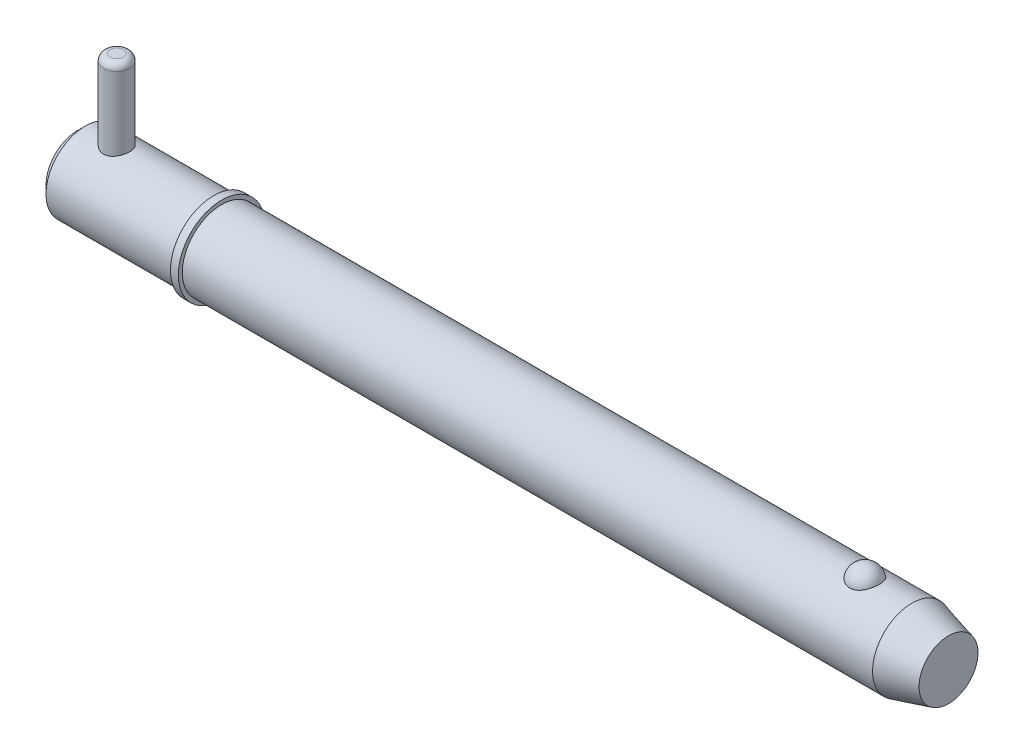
ISO-10303-21;
HEADER;
FILE_DESCRIPTION(('STEP AP214'),'2;1');
FILE_NAME('part.step','',(''),(''),'','','');
FILE_SCHEMA(('AUTOMOTIVE_DESIGN { 1 0 10303 214 1 1 1 1 }'));
ENDSEC;
DATA;
#1=APPLICATION_CONTEXT('core data for automotive mechanical design processes');
#2=APPLICATION_PROTOCOL_DEFINITION('international standard','automotive_design',2000,#1);
#3=PRODUCT_CONTEXT('',#1,'mechanical');
#4=PRODUCT('Part','Part','',(#3));
#5=PRODUCT_RELATED_PRODUCT_CATEGORY('part','',(#4));
#6=PRODUCT_DEFINITION_FORMATION('','',#4);
#7=PRODUCT_DEFINITION_CONTEXT('part definition',#1,'design');
#8=PRODUCT_DEFINITION('design','',#6,#7);
#9=PRODUCT_DEFINITION_SHAPE('','',#8);
#10=(LENGTH_UNIT() NAMED_UNIT(*) SI_UNIT(.MILLI.,.METRE.));
#11=(NAMED_UNIT(*) PLANE_ANGLE_UNIT() SI_UNIT($,.RADIAN.));
#12=(NAMED_UNIT(*) SI_UNIT($,.STERADIAN.) SOLID_ANGLE_UNIT());
#13=UNCERTAINTY_MEASURE_WITH_UNIT(LENGTH_MEASURE(1.E-05),#10,'distance_accuracy_value','');
#14=(GEOMETRIC_REPRESENTATION_CONTEXT(3) GLOBAL_UNCERTAINTY_ASSIGNED_CONTEXT((#13)) GLOBAL_UNIT_ASSIGNED_CONTEXT((#10,
#11,#12)) REPRESENTATION_CONTEXT('',''));
#15=CARTESIAN_POINT('',(0.,0.,0.));
#16=DIRECTION('',(0.,0.,1.));
#17=DIRECTION('',(1.,0.,0.));
#18=AXIS2_PLACEMENT_3D('',#15,#16,#17);
#19=CARTESIAN_POINT('',(9.52500000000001,28.575,0.));
#20=DIRECTION('',(0.,-1.,0.));
#21=DIRECTION('',(0.,0.,-1.));
#22=AXIS2_PLACEMENT_3D('',#19,#20,#21);
#23=CYLINDRICAL_SURFACE('',#22,3.175);
#24=CARTESIAN_POINT('',(9.52500000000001,-7.93750000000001,0.));
#25=DIRECTION('',(0.,1.,0.));
#26=DIRECTION('',(0.,0.,1.));
#27=AXIS2_PLACEMENT_3D('',#24,#25,#26);
#28=CIRCLE('',#27,3.175);
#29=CARTESIAN_POINT('',(9.52500000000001,-7.93750000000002,-3.175));
#30=VERTEX_POINT('',#29);
#31=EDGE_CURVE('P0_E25',#30,#30,#28,.T.);
#32=CARTESIAN_POINT('',(9.52500000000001,26.9875,0.));
#33=DIRECTION('',(0.,1.,0.));
#34=DIRECTION('',(0.,0.,1.));
#35=AXIS2_PLACEMENT_3D('',#32,#33,#34);
#36=CIRCLE('',#35,3.175);
#37=CARTESIAN_POINT('',(9.52500000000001,26.9875,-3.175));
#38=VERTEX_POINT('',#37);
#39=EDGE_CURVE('P0_E29',#38,#38,#36,.F.);
#40=CARTESIAN_POINT('',(9.52500000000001,-7.93750000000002,-3.175));
#41=CARTESIAN_POINT('',(9.52500000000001,-7.57369791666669,-3.175));
#42=CARTESIAN_POINT('',(9.52500000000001,-7.20989583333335,-3.175));
#43=CARTESIAN_POINT('',(9.52500000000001,-6.48229166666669,-3.175));
#44=CARTESIAN_POINT('',(9.52500000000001,-6.11848958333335,-3.175));
#45=CARTESIAN_POINT('',(9.52500000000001,-5.39088541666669,-3.175));
#46=CARTESIAN_POINT('',(9.52500000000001,-5.02708333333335,-3.175));
#47=CARTESIAN_POINT('',(9.52500000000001,-4.29947916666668,-3.175));
#48=CARTESIAN_POINT('',(9.52500000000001,-3.93567708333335,-3.175));
#49=CARTESIAN_POINT('',(9.52500000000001,-3.20807291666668,-3.175));
#50=CARTESIAN_POINT('',(9.52500000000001,-2.84427083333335,-3.175));
#51=CARTESIAN_POINT('',(9.52500000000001,-2.11666666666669,-3.175));
#52=CARTESIAN_POINT('',(9.52500000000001,-1.75286458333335,-3.175));
#53=CARTESIAN_POINT('',(9.52500000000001,-1.02526041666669,-3.175));
#54=CARTESIAN_POINT('',(9.52500000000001,-0.661458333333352,-3.175));
#55=CARTESIAN_POINT('',(9.52500000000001,0.0661458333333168,-3.175));
#56=CARTESIAN_POINT('',(9.52500000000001,0.429947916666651,-3.175));
#57=CARTESIAN_POINT('',(9.52500000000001,1.15755208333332,-3.175));
#58=CARTESIAN_POINT('',(9.52500000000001,1.52135416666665,-3.175));
#59=CARTESIAN_POINT('',(9.52500000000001,2.24895833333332,-3.175));
#60=CARTESIAN_POINT('',(9.52500000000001,2.61276041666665,-3.175));
#61=CARTESIAN_POINT('',(9.52500000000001,3.34036458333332,-3.175));
#62=CARTESIAN_POINT('',(9.52500000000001,3.70416666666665,-3.175));
#63=CARTESIAN_POINT('',(9.52500000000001,4.43177083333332,-3.175));
#64=CARTESIAN_POINT('',(9.52500000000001,4.79557291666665,-3.175));
#65=CARTESIAN_POINT('',(9.52500000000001,5.52317708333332,-3.175));
#66=CARTESIAN_POINT('',(9.52500000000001,5.88697916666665,-3.175));
#67=CARTESIAN_POINT('',(9.52500000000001,6.61458333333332,-3.175));
#68=CARTESIAN_POINT('',(9.52500000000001,6.97838541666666,-3.175));
#69=CARTESIAN_POINT('',(9.52500000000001,7.70598958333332,-3.175));
#70=CARTESIAN_POINT('',(9.52500000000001,8.06979166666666,-3.175));
#71=CARTESIAN_POINT('',(9.52500000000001,8.79739583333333,-3.175));
#72=CARTESIAN_POINT('',(9.52500000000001,9.16119791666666,-3.175));
#73=CARTESIAN_POINT('',(9.52500000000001,9.88880208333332,-3.175));
#74=CARTESIAN_POINT('',(9.52500000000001,10.2526041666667,-3.175));
#75=CARTESIAN_POINT('',(9.52500000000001,10.9802083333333,-3.175));
#76=CARTESIAN_POINT('',(9.52500000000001,11.3440104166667,-3.175));
#77=CARTESIAN_POINT('',(9.52500000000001,12.0716145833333,-3.175));
#78=CARTESIAN_POINT('',(9.52500000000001,12.4354166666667,-3.175));
#79=CARTESIAN_POINT('',(9.52500000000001,13.1630208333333,-3.175));
#80=CARTESIAN_POINT('',(9.52500000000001,13.5268229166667,-3.175));
#81=CARTESIAN_POINT('',(9.52500000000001,14.2544270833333,-3.175));
#82=CARTESIAN_POINT('',(9.52500000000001,14.6182291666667,-3.175));
#83=CARTESIAN_POINT('',(9.52500000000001,15.3458333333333,-3.175));
#84=CARTESIAN_POINT('',(9.52500000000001,15.7096354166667,-3.175));
#85=CARTESIAN_POINT('',(9.52500000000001,16.4372395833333,-3.175));
#86=CARTESIAN_POINT('',(9.52500000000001,16.8010416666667,-3.175));
#87=CARTESIAN_POINT('',(9.52500000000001,17.5286458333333,-3.175));
#88=CARTESIAN_POINT('',(9.52500000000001,17.8924479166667,-3.175));
#89=CARTESIAN_POINT('',(9.52500000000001,18.6200520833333,-3.175));
#90=CARTESIAN_POINT('',(9.52500000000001,18.9838541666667,-3.175));
#91=CARTESIAN_POINT('',(9.52500000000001,19.7114583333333,-3.175));
#92=CARTESIAN_POINT('',(9.52500000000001,20.0752604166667,-3.175));
#93=CARTESIAN_POINT('',(9.52500000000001,20.8028645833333,-3.175));
#94=CARTESIAN_POINT('',(9.52500000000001,21.1666666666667,-3.175));
#95=CARTESIAN_POINT('',(9.52500000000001,21.8942708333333,-3.175));
#96=CARTESIAN_POINT('',(9.52500000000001,22.2580729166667,-3.175));
#97=CARTESIAN_POINT('',(9.52500000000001,22.9856770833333,-3.175));
#98=CARTESIAN_POINT('',(9.52500000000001,23.3494791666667,-3.175));
#99=CARTESIAN_POINT('',(9.52500000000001,24.0770833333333,-3.175));
#100=CARTESIAN_POINT('',(9.52500000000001,24.4408854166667,-3.175));
#101=CARTESIAN_POINT('',(9.52500000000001,25.1684895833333,-3.175));
#102=CARTESIAN_POINT('',(9.52500000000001,25.5322916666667,-3.175));
#103=CARTESIAN_POINT('',(9.52500000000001,26.2598958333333,-3.175));
#104=CARTESIAN_POINT('',(9.52500000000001,26.6236979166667,-3.175));
#105=CARTESIAN_POINT('',(9.52500000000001,26.9875,-3.175));
#106=B_SPLINE_CURVE_WITH_KNOTS('',3,(#40,#41,#42,#43,#44,#45,#46,#47,#48,#49,#50,#51,#52,#53,
#54,#55,#56,#57,#58,#59,#60,#61,#62,#63,#64,#65,#66,#67,#68,#69,#70,#71,#72,#73,#74,#75,#76,#77,
#78,#79,#80,#81,#82,#83,#84,#85,#86,#87,#88,#89,#90,#91,#92,#93,#94,#95,#96,#97,#98,#99,#100,
#101,#102,#103,#104,#105),.UNSPECIFIED.,.F.,.F.,(4,2,2,2,2,2,2,2,2,2,2,2,2,2,2,2,2,2,2,2,2,2,2,
2,2,2,2,2,2,2,2,2,4),(0.,1.09140625,2.1828125,3.27421875,4.365625,5.45703125,6.5484375,
7.63984375,8.73125000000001,9.82265625,10.9140625,12.00546875,13.096875,14.18828125,15.2796875,
16.37109375,17.4625,18.55390625,19.6453125,20.73671875,21.828125,22.91953125,24.0109375,
25.10234375,26.19375,27.28515625,28.3765625,29.46796875,30.559375,31.65078125,32.7421875,
33.83359375,34.925),.UNSPECIFIED.);
#107=EDGE_CURVE('P0_BSEAM14',#30,#38,#106,.T.);
#108=ORIENTED_EDGE('',*,*,#31,.T.);
#109=ORIENTED_EDGE('',*,*,#39,.T.);
#110=ORIENTED_EDGE('',*,*,#107,.T.);
#111=ORIENTED_EDGE('',*,*,#107,.F.);
#112=EDGE_LOOP('',(#108,#110,#109,#111));
#113=FACE_BOUND('',#112,.T.);
#114=ADVANCED_FACE('P0_F14',(#113),#23,.T.);
#115=CARTESIAN_POINT('',(9.52500000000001,28.575,0.));
#116=DIRECTION('',(0.,1.,0.));
#117=DIRECTION('',(0.,0.,1.));
#118=AXIS2_PLACEMENT_3D('',#115,#116,#117);
#119=PLANE('',#118);
#120=CARTESIAN_POINT('',(9.52500000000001,28.575,0.));
#121=DIRECTION('',(0.,1.,0.));
#122=DIRECTION('',(0.,0.,1.));
#123=AXIS2_PLACEMENT_3D('',#120,#121,#122);
#124=CIRCLE('',#123,1.5875);
#125=CARTESIAN_POINT('',(9.52500000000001,28.575,1.5875));
#126=VERTEX_POINT('',#125);
#127=EDGE_CURVE('P0_E10',#126,#126,#124,.T.);
#128=ORIENTED_EDGE('',*,*,#127,.T.);
#129=EDGE_LOOP('',(#128));
#130=FACE_BOUND('',#129,.T.);
#131=ADVANCED_FACE('P0_F46',(#130),#119,.T.);
#132=CARTESIAN_POINT('',(9.52500000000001,-9.525,0.));
#133=DIRECTION('',(0.,1.,0.));
#134=DIRECTION('',(0.,0.,1.));
#135=AXIS2_PLACEMENT_3D('',#132,#133,#134);
#136=PLANE('',#135);
#137=CARTESIAN_POINT('',(9.52500000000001,-9.525,0.));
#138=DIRECTION('',(0.,1.,0.));
#139=DIRECTION('',(0.,0.,1.));
#140=AXIS2_PLACEMENT_3D('',#137,#138,#139);
#141=CIRCLE('',#140,1.5875);
#142=CARTESIAN_POINT('',(9.52500000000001,-9.525,1.5875));
#143=VERTEX_POINT('',#142);
#144=EDGE_CURVE('P0_E21',#143,#143,#141,.F.);
#145=ORIENTED_EDGE('',*,*,#144,.T.);
#146=EDGE_LOOP('',(#145));
#147=FACE_BOUND('',#146,.T.);
#148=ADVANCED_FACE('P0_F43',(#147),#136,.F.);
#149=CARTESIAN_POINT('',(9.52500000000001,-7.9375,0.));
#150=DIRECTION('',(0.,1.,0.));
#151=DIRECTION('',(0.,0.,1.));
#152=AXIS2_PLACEMENT_3D('',#149,#150,#151);
#153=DEGENERATE_TOROIDAL_SURFACE('',#152,1.5875,1.5875,.T.);
#154=ORIENTED_EDGE('',*,*,#144,.F.);
#155=EDGE_LOOP('',(#154));
#156=FACE_BOUND('',#155,.T.);
#157=ORIENTED_EDGE('',*,*,#31,.F.);
#158=EDGE_LOOP('',(#157));
#159=FACE_BOUND('',#158,.T.);
#160=ADVANCED_FACE('P0_F38',(#156,#159),#153,.T.);
#161=CARTESIAN_POINT('',(9.52500000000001,26.9875,0.));
#162=DIRECTION('',(0.,1.,0.));
#163=DIRECTION('',(0.,0.,1.));
#164=AXIS2_PLACEMENT_3D('',#161,#162,#163);
#165=DEGENERATE_TOROIDAL_SURFACE('',#164,1.5875,1.5875,.T.);
#166=ORIENTED_EDGE('',*,*,#39,.F.);
#167=EDGE_LOOP('',(#166));
#168=FACE_BOUND('',#167,.T.);
#169=ORIENTED_EDGE('',*,*,#127,.F.);
#170=EDGE_LOOP('',(#169));
#171=FACE_BOUND('',#170,.T.);
#172=ADVANCED_FACE('P0_F16',(#168,#171),#165,.T.);
#173=CLOSED_SHELL('',(#114,#131,#148,#160,#172));
#174=MANIFOLD_SOLID_BREP('P0_B1',#173);
#175=CARTESIAN_POINT('',(0.,0.,0.));
#176=DIRECTION('',(1.,0.,0.));
#177=DIRECTION('',(0.,0.,-1.));
#178=AXIS2_PLACEMENT_3D('',#175,#176,#177);
#179=CYLINDRICAL_SURFACE('',#178,9.525);
#180=CARTESIAN_POINT('',(202.243054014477,0.,0.));
#181=DIRECTION('',(1.,0.,0.));
#182=DIRECTION('',(0.,0.,-1.));
#183=AXIS2_PLACEMENT_3D('',#180,#181,#182);
#184=CIRCLE('',#183,9.525);
#185=CARTESIAN_POINT('',(202.243054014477,0.,-9.525));
#186=VERTEX_POINT('',#185);
#187=EDGE_CURVE('P1_E81',#186,#186,#184,.T.);
#188=ORIENTED_EDGE('',*,*,#187,.F.);
#189=EDGE_LOOP('',(#188));
#190=FACE_BOUND('',#189,.T.);
#191=CARTESIAN_POINT('',(34.93,0.,0.));
#192=DIRECTION('',(1.,0.,0.));
#193=DIRECTION('',(0.,0.,-1.));
#194=AXIS2_PLACEMENT_3D('',#191,#192,#193);
#195=CIRCLE('',#194,9.525);
#196=CARTESIAN_POINT('',(34.93,0.,-9.525));
#197=VERTEX_POINT('',#196);
#198=EDGE_CURVE('P1_E85',#197,#197,#195,.T.);
#199=ORIENTED_EDGE('',*,*,#198,.T.);
#200=EDGE_LOOP('',(#199));
#201=FACE_BOUND('',#200,.T.);
#202=CARTESIAN_POINT('',(190.845757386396,8.80405803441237,3.63513233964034));
#203=CARTESIAN_POINT('',(190.751676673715,8.80405953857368,3.63513053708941));
#204=CARTESIAN_POINT('',(190.657561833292,8.80561325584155,3.63137461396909));
#205=CARTESIAN_POINT('',(190.470012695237,8.81177748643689,3.61638665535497));
#206=CARTESIAN_POINT('',(190.376578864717,8.81638992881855,3.60514990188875));
#207=CARTESIAN_POINT('',(190.097945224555,8.83467114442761,3.56024627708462));
#208=CARTESIAN_POINT('',(189.914691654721,8.85278327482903,3.51538626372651));
#209=CARTESIAN_POINT('',(189.559509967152,8.89871214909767,3.39742145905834));
#210=CARTESIAN_POINT('',(189.387553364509,8.92650327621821,3.32439116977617));
#211=CARTESIAN_POINT('',(189.058707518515,8.98874819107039,3.15220244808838));
#212=CARTESIAN_POINT('',(188.901811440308,9.02319893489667,3.05305594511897));
#213=CARTESIAN_POINT('',(188.602214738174,9.09629186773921,2.82797815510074));
#214=CARTESIAN_POINT('',(188.460060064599,9.13502685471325,2.70135138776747));
#215=CARTESIAN_POINT('',(188.198299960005,9.21186572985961,2.42641932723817));
#216=CARTESIAN_POINT('',(188.078701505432,9.24996941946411,2.2781073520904));
#217=CARTESIAN_POINT('',(187.859645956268,9.32341082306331,1.95652290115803));
#218=CARTESIAN_POINT('',(187.761317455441,9.35855090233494,1.78243511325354));
#219=CARTESIAN_POINT('',(187.593819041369,9.42045142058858,1.41937246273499));
#220=CARTESIAN_POINT('',(187.524651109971,9.44721128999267,1.23039658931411));
#221=CARTESIAN_POINT('',(187.416199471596,9.48990641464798,0.840370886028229));
#222=CARTESIAN_POINT('',(187.377288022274,9.50570658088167,0.639202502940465));
#223=CARTESIAN_POINT('',(187.331555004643,9.52433146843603,0.232664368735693));
#224=CARTESIAN_POINT('',(187.324732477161,9.52715657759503,0.0272947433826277));
#225=CARTESIAN_POINT('',(187.343255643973,9.51956918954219,-0.380478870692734));
#226=CARTESIAN_POINT('',(187.368405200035,9.50923740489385,-0.582893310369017));
#227=CARTESIAN_POINT('',(187.45002537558,9.47651897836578,-0.980293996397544));
#228=CARTESIAN_POINT('',(187.506496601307,9.45413210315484,-1.17528009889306));
#229=CARTESIAN_POINT('',(187.649719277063,9.39954044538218,-1.55263697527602));
#230=CARTESIAN_POINT('',(187.736512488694,9.36732213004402,-1.73498993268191));
#231=CARTESIAN_POINT('',(187.938610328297,9.29640700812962,-2.08177763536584));
#232=CARTESIAN_POINT('',(188.053917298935,9.25770966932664,-2.24621090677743));
#233=CARTESIAN_POINT('',(188.311264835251,9.17775604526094,-2.5533833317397));
#234=CARTESIAN_POINT('',(188.453434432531,9.136488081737,-2.696011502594));
#235=CARTESIAN_POINT('',(188.76089985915,9.05620497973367,-2.95451229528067));
#236=CARTESIAN_POINT('',(188.926193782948,9.01718965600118,-3.07038711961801));
#237=CARTESIAN_POINT('',(189.272052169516,8.94680019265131,-3.26976836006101));
#238=CARTESIAN_POINT('',(189.452227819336,8.91528408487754,-3.35389750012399));
#239=CARTESIAN_POINT('',(189.825651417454,8.86272514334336,-3.49043503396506));
#240=CARTESIAN_POINT('',(190.018894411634,8.84167836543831,-3.54285537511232));
#241=CARTESIAN_POINT('',(190.402503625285,8.81348056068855,-3.61241306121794));
#242=CARTESIAN_POINT('',(190.592525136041,8.80568348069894,-3.6311933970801));
#243=CARTESIAN_POINT('',(190.973190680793,8.80289410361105,-3.63795342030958));
#244=CARTESIAN_POINT('',(191.163834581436,8.80789922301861,-3.62593932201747));
#245=CARTESIAN_POINT('',(191.534007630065,8.82974915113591,-3.57238430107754));
#246=CARTESIAN_POINT('',(191.713697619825,8.84621463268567,-3.53178890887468));
#247=CARTESIAN_POINT('',(192.063422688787,8.88875330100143,-3.42331083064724));
#248=CARTESIAN_POINT('',(192.233456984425,8.91482726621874,-3.35542593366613));
#249=CARTESIAN_POINT('',(192.563237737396,8.97448239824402,-3.19248225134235));
#250=CARTESIAN_POINT('',(192.722680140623,9.00821446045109,-3.0968647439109));
#251=CARTESIAN_POINT('',(193.023513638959,9.07935398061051,-2.88162736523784));
#252=CARTESIAN_POINT('',(193.164900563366,9.11676228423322,-2.76200196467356));
#253=CARTESIAN_POINT('',(193.43331931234,9.19347419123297,-2.49516285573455));
#254=CARTESIAN_POINT('',(193.559275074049,9.23277872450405,-2.34686614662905));
#255=CARTESIAN_POINT('',(193.785522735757,9.3073761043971,-2.03093683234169));
#256=CARTESIAN_POINT('',(193.88581004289,9.34266823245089,-1.86330077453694));
#257=CARTESIAN_POINT('',(194.061514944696,9.40674710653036,-1.50744893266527));
#258=CARTESIAN_POINT('',(194.136041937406,9.43529176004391,-1.31874876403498));
#259=CARTESIAN_POINT('',(194.25416505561,9.48144132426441,-0.930631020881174));
#260=CARTESIAN_POINT('',(194.297760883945,9.49904612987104,-0.731213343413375));
#261=CARTESIAN_POINT('',(194.353158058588,9.5215314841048,-0.327147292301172));
#262=CARTESIAN_POINT('',(194.364935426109,9.52640243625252,-0.122495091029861));
#263=CARTESIAN_POINT('',(194.356382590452,9.5228957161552,0.28601848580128));
#264=CARTESIAN_POINT('',(194.33605305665,9.5145183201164,0.489879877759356));
#265=CARTESIAN_POINT('',(194.263884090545,9.48544083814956,0.88999431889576));
#266=CARTESIAN_POINT('',(194.212199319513,9.46480124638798,1.08627971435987));
#267=CARTESIAN_POINT('',(194.078491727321,9.4133389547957,1.46682086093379));
#268=CARTESIAN_POINT('',(193.996466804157,9.38251554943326,1.65107577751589));
#269=CARTESIAN_POINT('',(193.80319292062,9.31365636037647,2.00346348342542));
#270=CARTESIAN_POINT('',(193.691783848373,9.27558138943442,2.17150083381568));
#271=CARTESIAN_POINT('',(193.442294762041,9.19638714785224,2.48563115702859));
#272=CARTESIAN_POINT('',(193.304216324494,9.15526805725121,2.63172542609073));
#273=CARTESIAN_POINT('',(193.004843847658,9.07465393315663,2.89750997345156));
#274=CARTESIAN_POINT('',(192.843610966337,9.03515496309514,3.01726776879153));
#275=CARTESIAN_POINT('',(192.501613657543,8.96227564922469,3.22732920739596));
#276=CARTESIAN_POINT('',(192.320841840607,8.92889763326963,3.31762165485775));
#277=CARTESIAN_POINT('',(191.951445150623,8.8734538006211,3.46314419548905));
#278=CARTESIAN_POINT('',(191.76332371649,8.85102983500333,3.51950082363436));
#279=CARTESIAN_POINT('',(191.47578699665,8.8266696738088,3.57993683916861));
#280=CARTESIAN_POINT('',(191.379133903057,8.82009725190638,3.5960621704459));
#281=CARTESIAN_POINT('',(191.184677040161,8.81020897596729,3.62022512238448));
#282=CARTESIAN_POINT('',(191.086874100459,8.80689090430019,3.62826825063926));
#283=CARTESIAN_POINT('',(190.941224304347,8.80445615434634,3.63416760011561));
#284=CARTESIAN_POINT('',(190.893495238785,8.80405727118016,3.63513325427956));
#285=CARTESIAN_POINT('',(190.845757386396,8.80405803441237,3.63513233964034));
#286=B_SPLINE_CURVE_WITH_KNOTS('',3,(#202,#203,#204,#205,#206,#207,#208,#209,#210,#211,#212,
#213,#214,#215,#216,#217,#218,#219,#220,#221,#222,#223,#224,#225,#226,#227,#228,#229,#230,#231,
#232,#233,#234,#235,#236,#237,#238,#239,#240,#241,#242,#243,#244,#245,#246,#247,#248,#249,#250,
#251,#252,#253,#254,#255,#256,#257,#258,#259,#260,#261,#262,#263,#264,#265,#266,#267,#268,#269,
#270,#271,#272,#273,#274,#275,#276,#277,#278,#279,#280,#281,#282,#283,#284,#285),.UNSPECIFIED.,
.T.,.F.,(4,2,2,2,2,2,2,2,2,2,2,2,2,2,2,2,2,2,2,2,2,2,2,2,2,2,2,2,2,2,2,2,2,2,2,2,2,2,2,2,2,4),
(0.,0.282202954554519,0.564584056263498,1.13017050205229,1.69427128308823,2.25811483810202,
2.83836627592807,3.41879688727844,4.02497117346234,4.63118665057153,5.24474754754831,
5.85829010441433,6.46808687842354,7.07789545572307,7.68854723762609,8.299249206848,
8.91296283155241,9.52662591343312,10.1275338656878,10.7282152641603,11.2986646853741,
11.8689989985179,12.4213015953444,12.973648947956,13.5380053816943,14.1024919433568,
14.695298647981,15.2882113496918,15.8999469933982,16.5116885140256,17.1238909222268,
17.7360805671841,18.3452748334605,18.9545113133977,19.567138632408,20.179729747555,
20.7907316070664,21.4019653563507,21.9915938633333,22.2859053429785,22.5800161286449,
22.7232098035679),.UNSPECIFIED.);
#287=CARTESIAN_POINT('',(190.845757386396,8.80405803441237,3.63513233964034));
#288=VERTEX_POINT('',#287);
#289=EDGE_CURVE('P1_E35',#288,#288,#286,.T.);
#290=ORIENTED_EDGE('',*,*,#289,.T.);
#291=EDGE_LOOP('',(#290));
#292=FACE_BOUND('',#291,.T.);
#293=ADVANCED_FACE('P1_F13',(#190,#201,#292),#179,.T.);
#294=CARTESIAN_POINT('',(0.,0.,0.));
#295=DIRECTION('',(-1.,0.,0.));
#296=DIRECTION('',(0.,0.,1.));
#297=AXIS2_PLACEMENT_3D('',#294,#295,#296);
#298=PLANE('',#297);
#299=CARTESIAN_POINT('',(0.,0.,0.));
#300=DIRECTION('',(1.,0.,0.));
#301=DIRECTION('',(0.,0.,-1.));
#302=AXIS2_PLACEMENT_3D('',#299,#300,#301);
#303=CIRCLE('',#302,7.62);
#304=CARTESIAN_POINT('',(0.,0.,-7.62));
#305=VERTEX_POINT('',#304);
#306=EDGE_CURVE('P1_E9',#305,#305,#303,.T.);
#307=ORIENTED_EDGE('',*,*,#306,.F.);
#308=EDGE_LOOP('',(#307));
#309=FACE_BOUND('',#308,.T.);
#310=ADVANCED_FACE('P1_F15',(#309),#298,.T.);
#311=CARTESIAN_POINT('',(1.90499999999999,0.,0.));
#312=DIRECTION('',(1.,0.,0.));
#313=DIRECTION('',(0.,0.,-1.));
#314=AXIS2_PLACEMENT_3D('',#311,#312,#313);
#315=CONICAL_SURFACE('',#314,9.525,0.785398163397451);
#316=ORIENTED_EDGE('',*,*,#306,.T.);
#317=EDGE_LOOP('',(#316));
#318=FACE_BOUND('',#317,.T.);
#319=CARTESIAN_POINT('',(1.90499999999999,0.,0.));
#320=DIRECTION('',(1.,0.,0.));
#321=DIRECTION('',(0.,0.,-1.));
#322=AXIS2_PLACEMENT_3D('',#319,#320,#321);
#323=CIRCLE('',#322,9.525);
#324=CARTESIAN_POINT('',(1.90499999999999,0.,-9.525));
#325=VERTEX_POINT('',#324);
#326=EDGE_CURVE('P1_E26',#325,#325,#323,.T.);
#327=ORIENTED_EDGE('',*,*,#326,.F.);
#328=EDGE_LOOP('',(#327));
#329=FACE_BOUND('',#328,.T.);
#330=ADVANCED_FACE('P1_F77',(#318,#329),#315,.T.);
#331=CARTESIAN_POINT('',(0.,0.,0.));
#332=DIRECTION('',(1.,0.,0.));
#333=DIRECTION('',(0.,0.,-1.));
#334=AXIS2_PLACEMENT_3D('',#331,#332,#333);
#335=CYLINDRICAL_SURFACE('',#334,9.525);
#336=CARTESIAN_POINT('',(9.525,-8.98025612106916,3.175));
#337=CARTESIAN_POINT('',(9.35206354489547,-8.98025555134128,3.17500081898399));
#338=CARTESIAN_POINT('',(9.17913201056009,-8.98530617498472,3.16082293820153));
#339=CARTESIAN_POINT('',(8.83839221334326,-9.00485797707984,3.10467734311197));
#340=CARTESIAN_POINT('',(8.67058479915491,-9.0193607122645,3.06270505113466));
#341=CARTESIAN_POINT('',(8.34508461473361,-9.05599546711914,2.95260866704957));
#342=CARTESIAN_POINT('',(8.18737272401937,-9.07811252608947,2.88453582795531));
#343=CARTESIAN_POINT('',(7.88555684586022,-9.12746212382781,2.72434567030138));
#344=CARTESIAN_POINT('',(7.74145587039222,-9.1546957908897,2.63222304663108));
#345=CARTESIAN_POINT('',(7.46531411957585,-9.21240503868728,2.42268738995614));
#346=CARTESIAN_POINT('',(7.33388351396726,-9.24296141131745,2.30449228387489));
#347=CARTESIAN_POINT('',(7.09229340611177,-9.30319020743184,2.0478358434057));
#348=CARTESIAN_POINT('',(6.98213731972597,-9.33286248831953,1.90937126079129));
#349=CARTESIAN_POINT('',(6.78345450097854,-9.38891527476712,1.61164431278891));
#350=CARTESIAN_POINT('',(6.69556709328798,-9.41518969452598,1.45193356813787));
#351=CARTESIAN_POINT('',(6.54814671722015,-9.46053437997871,1.11896913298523));
#352=CARTESIAN_POINT('',(6.48860610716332,-9.47960658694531,0.945719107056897));
#353=CARTESIAN_POINT('',(6.40163866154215,-9.50782564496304,0.596991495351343));
#354=CARTESIAN_POINT('',(6.373166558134,-9.5172947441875,0.421801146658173));
#355=CARTESIAN_POINT('',(6.3458207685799,-9.52638456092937,0.068890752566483));
#356=CARTESIAN_POINT('',(6.34693945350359,-9.52600781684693,-0.108828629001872));
#357=CARTESIAN_POINT('',(6.37808050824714,-9.51566675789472,-0.454353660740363));
#358=CARTESIAN_POINT('',(6.4069675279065,-9.50607905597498,-0.622274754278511));
#359=CARTESIAN_POINT('',(6.490947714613,-9.47886621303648,-0.950732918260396));
#360=CARTESIAN_POINT('',(6.54604265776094,-9.46124052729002,-1.11126948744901));
#361=CARTESIAN_POINT('',(6.68153768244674,-9.41945253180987,-1.42288410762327));
#362=CARTESIAN_POINT('',(6.76226085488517,-9.3952073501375,-1.57381010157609));
#363=CARTESIAN_POINT('',(6.94645456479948,-9.34270397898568,-1.86030973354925));
#364=CARTESIAN_POINT('',(7.04993142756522,-9.31444467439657,-1.99587908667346));
#365=CARTESIAN_POINT('',(7.28241619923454,-9.25532159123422,-2.2545702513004));
#366=CARTESIAN_POINT('',(7.4123967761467,-9.22439783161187,-2.37680549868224));
#367=CARTESIAN_POINT('',(7.69127470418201,-9.1645528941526,-2.5980302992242));
#368=CARTESIAN_POINT('',(7.84017496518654,-9.13563202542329,-2.6970162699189));
#369=CARTESIAN_POINT('',(8.15547526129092,-9.08273917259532,-2.87016016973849));
#370=CARTESIAN_POINT('',(8.32209451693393,-9.05884361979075,-2.94394402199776));
#371=CARTESIAN_POINT('',(8.66638917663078,-9.01959241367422,-3.06210713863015));
#372=CARTESIAN_POINT('',(8.84405991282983,-9.00423318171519,-3.10649872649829));
#373=CARTESIAN_POINT('',(9.19682677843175,-8.98460345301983,-3.16281207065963));
#374=CARTESIAN_POINT('',(9.37167742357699,-8.9798639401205,-3.17610837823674));
#375=CARTESIAN_POINT('',(9.72113927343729,-8.9806993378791,-3.17374726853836));
#376=CARTESIAN_POINT('',(9.89575051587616,-8.98627237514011,-3.15809511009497));
#377=CARTESIAN_POINT('',(10.2335233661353,-9.00663737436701,-3.09951644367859));
#378=CARTESIAN_POINT('',(10.3968722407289,-9.02110608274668,-3.05754530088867));
#379=CARTESIAN_POINT('',(10.7141759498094,-9.05727657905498,-2.94866651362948));
#380=CARTESIAN_POINT('',(10.8681291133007,-9.07897964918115,-2.88175444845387));
#381=CARTESIAN_POINT('',(11.1676828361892,-9.12802586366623,-2.72248103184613));
#382=CARTESIAN_POINT('',(11.3128635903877,-9.1555260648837,-2.62937980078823));
#383=CARTESIAN_POINT('',(11.5860387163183,-9.21276315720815,-2.42120937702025));
#384=CARTESIAN_POINT('',(11.7140280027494,-9.24250070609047,-2.30613370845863));
#385=CARTESIAN_POINT('',(11.9555513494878,-9.30259247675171,-2.05070616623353));
#386=CARTESIAN_POINT('',(12.0680936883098,-9.33290753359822,-1.90940458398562));
#387=CARTESIAN_POINT('',(12.267933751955,-9.3893275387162,-1.60917665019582));
#388=CARTESIAN_POINT('',(12.3552323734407,-9.41543263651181,-1.45025092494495));
#389=CARTESIAN_POINT('',(12.5013088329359,-9.46036988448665,-1.12007606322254));
#390=CARTESIAN_POINT('',(12.5602723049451,-9.47924920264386,-0.9489158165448));
#391=CARTESIAN_POINT('',(12.6483355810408,-9.50781089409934,-0.598355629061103));
#392=CARTESIAN_POINT('',(12.6774461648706,-9.5174965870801,-0.4189586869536));
#393=CARTESIAN_POINT('',(12.7040070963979,-9.52632915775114,-0.066088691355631));
#394=CARTESIAN_POINT('',(12.7028811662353,-9.52594996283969,0.107266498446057));
#395=CARTESIAN_POINT('',(12.6725130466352,-9.51586223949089,0.451202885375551));
#396=CARTESIAN_POINT('',(12.643273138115,-9.50615446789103,0.621784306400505));
#397=CARTESIAN_POINT('',(12.5584514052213,-9.47867404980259,0.952633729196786));
#398=CARTESIAN_POINT('',(12.5032953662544,-9.46103195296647,1.1130225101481));
#399=CARTESIAN_POINT('',(12.3686013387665,-9.41949985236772,1.42233126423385));
#400=CARTESIAN_POINT('',(12.2890589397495,-9.39560871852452,1.57124915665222));
#401=CARTESIAN_POINT('',(12.1044667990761,-9.34294133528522,1.85938800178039));
#402=CARTESIAN_POINT('',(11.9985831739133,-9.31401720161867,1.9980473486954));
#403=CARTESIAN_POINT('',(11.7657327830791,-9.25490239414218,2.25609475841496));
#404=CARTESIAN_POINT('',(11.6387592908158,-9.22471131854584,2.37547664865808));
#405=CARTESIAN_POINT('',(11.3613902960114,-9.16505913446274,2.59633024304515));
#406=CARTESIAN_POINT('',(11.2102725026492,-9.13567286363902,2.69691791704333));
#407=CARTESIAN_POINT('',(10.8923631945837,-9.08241113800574,2.87119803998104));
#408=CARTESIAN_POINT('',(10.7255757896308,-9.05853424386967,2.94489751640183));
#409=CARTESIAN_POINT('',(10.3887212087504,-9.02021736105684,3.06020415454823));
#410=CARTESIAN_POINT('',(10.219143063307,-9.00539959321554,3.10311136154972));
#411=CARTESIAN_POINT('',(9.87470703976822,-8.98542092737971,3.16050396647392));
#412=CARTESIAN_POINT('',(9.699851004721,-8.98025669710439,3.17499917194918));
#413=CARTESIAN_POINT('',(9.525,-8.98025612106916,3.175));
#414=B_SPLINE_CURVE_WITH_KNOTS('',3,(#336,#337,#338,#339,#340,#341,#342,#343,#344,#345,#346,
#347,#348,#349,#350,#351,#352,#353,#354,#355,#356,#357,#358,#359,#360,#361,#362,#363,#364,#365,
#366,#367,#368,#369,#370,#371,#372,#373,#374,#375,#376,#377,#378,#379,#380,#381,#382,#383,#384,
#385,#386,#387,#388,#389,#390,#391,#392,#393,#394,#395,#396,#397,#398,#399,#400,#401,#402,#403,
#404,#405,#406,#407,#408,#409,#410,#411,#412,#413),.UNSPECIFIED.,.T.,.F.,(4,2,2,2,2,2,2,2,2,2,2,
2,2,2,2,2,2,2,2,2,2,2,2,2,2,2,2,2,2,2,2,2,2,2,2,2,2,2,4),(0.,0.518161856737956,1.03640907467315,
1.55364379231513,2.07099270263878,2.60671746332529,3.14252816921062,3.69231882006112,
4.24196117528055,4.77247962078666,5.30286129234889,5.81244090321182,6.32205505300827,
6.83836754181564,7.3548237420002,7.89559553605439,8.43645060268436,8.98501631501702,
9.53335188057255,10.056948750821,10.5804505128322,11.0859695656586,11.5915782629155,
12.1132237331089,12.6350231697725,13.1819271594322,13.7288117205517,14.2720628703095,
14.815117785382,15.3326491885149,15.8501386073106,16.3594083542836,16.868770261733,
17.3969527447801,17.925304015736,18.4743376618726,19.023227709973,19.5473069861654,
20.0712053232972),.UNSPECIFIED.);
#415=CARTESIAN_POINT('',(9.525,-8.98025612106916,3.175));
#416=VERTEX_POINT('',#415);
#417=EDGE_CURVE('P1_E17',#416,#416,#414,.T.);
#418=ORIENTED_EDGE('',*,*,#417,.F.);
#419=EDGE_LOOP('',(#418));
#420=FACE_BOUND('',#419,.T.);
#421=CARTESIAN_POINT('',(9.525,8.98025612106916,3.175));
#422=CARTESIAN_POINT('',(9.69793645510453,8.98025555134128,3.17500081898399));
#423=CARTESIAN_POINT('',(9.87086798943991,8.98530617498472,3.16082293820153));
#424=CARTESIAN_POINT('',(10.2116077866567,9.00485797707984,3.10467734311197));
#425=CARTESIAN_POINT('',(10.3794152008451,9.0193607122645,3.06270505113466));
#426=CARTESIAN_POINT('',(10.7049153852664,9.05599546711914,2.95260866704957));
#427=CARTESIAN_POINT('',(10.8626272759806,9.07811252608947,2.88453582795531));
#428=CARTESIAN_POINT('',(11.1644431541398,9.12746212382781,2.72434567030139));
#429=CARTESIAN_POINT('',(11.3085441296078,9.15469579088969,2.63222304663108));
#430=CARTESIAN_POINT('',(11.5846858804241,9.21240503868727,2.42268738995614));
#431=CARTESIAN_POINT('',(11.7161164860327,9.24296141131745,2.30449228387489));
#432=CARTESIAN_POINT('',(11.9577065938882,9.30319020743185,2.0478358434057));
#433=CARTESIAN_POINT('',(12.067862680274,9.33286248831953,1.90937126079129));
#434=CARTESIAN_POINT('',(12.2665454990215,9.38891527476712,1.61164431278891));
#435=CARTESIAN_POINT('',(12.354432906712,9.41518969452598,1.45193356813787));
#436=CARTESIAN_POINT('',(12.5018532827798,9.46053437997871,1.11896913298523));
#437=CARTESIAN_POINT('',(12.5613938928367,9.47960658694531,0.945719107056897));
#438=CARTESIAN_POINT('',(12.6483613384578,9.50782564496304,0.596991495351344));
#439=CARTESIAN_POINT('',(12.676833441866,9.5172947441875,0.421801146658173));
#440=CARTESIAN_POINT('',(12.7041792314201,9.52638456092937,0.0688907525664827));
#441=CARTESIAN_POINT('',(12.7030605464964,9.52600781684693,-0.108828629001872));
#442=CARTESIAN_POINT('',(12.6719194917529,9.51566675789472,-0.454353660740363));
#443=CARTESIAN_POINT('',(12.6430324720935,9.50607905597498,-0.622274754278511));
#444=CARTESIAN_POINT('',(12.559052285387,9.47886621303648,-0.950732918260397));
#445=CARTESIAN_POINT('',(12.5039573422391,9.46124052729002,-1.11126948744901));
#446=CARTESIAN_POINT('',(12.3684623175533,9.41945253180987,-1.42288410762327));
#447=CARTESIAN_POINT('',(12.2877391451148,9.3952073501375,-1.57381010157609));
#448=CARTESIAN_POINT('',(12.1035454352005,9.34270397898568,-1.86030973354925));
#449=CARTESIAN_POINT('',(12.0000685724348,9.31444467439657,-1.99587908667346));
#450=CARTESIAN_POINT('',(11.7675838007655,9.25532159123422,-2.2545702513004));
#451=CARTESIAN_POINT('',(11.6376032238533,9.22439783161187,-2.37680549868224));
#452=CARTESIAN_POINT('',(11.358725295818,9.1645528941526,-2.5980302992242));
#453=CARTESIAN_POINT('',(11.2098250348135,9.13563202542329,-2.6970162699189));
#454=CARTESIAN_POINT('',(10.8945247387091,9.08273917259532,-2.87016016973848));
#455=CARTESIAN_POINT('',(10.7279054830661,9.05884361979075,-2.94394402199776));
#456=CARTESIAN_POINT('',(10.3836108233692,9.01959241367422,-3.06210713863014));
#457=CARTESIAN_POINT('',(10.2059400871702,9.00423318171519,-3.10649872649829));
#458=CARTESIAN_POINT('',(9.85317322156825,8.98460345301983,-3.16281207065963));
#459=CARTESIAN_POINT('',(9.67832257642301,8.9798639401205,-3.17610837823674));
#460=CARTESIAN_POINT('',(9.32886072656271,8.9806993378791,-3.17374726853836));
#461=CARTESIAN_POINT('',(9.15424948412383,8.98627237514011,-3.15809511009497));
#462=CARTESIAN_POINT('',(8.81647663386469,9.00663737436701,-3.09951644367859));
#463=CARTESIAN_POINT('',(8.65312775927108,9.02110608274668,-3.05754530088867));
#464=CARTESIAN_POINT('',(8.33582405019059,9.05727657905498,-2.94866651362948));
#465=CARTESIAN_POINT('',(8.18187088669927,9.07897964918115,-2.88175444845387));
#466=CARTESIAN_POINT('',(7.88231716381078,9.12802586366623,-2.72248103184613));
#467=CARTESIAN_POINT('',(7.73713640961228,9.1555260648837,-2.62937980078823));
#468=CARTESIAN_POINT('',(7.46396128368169,9.21276315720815,-2.42120937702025));
#469=CARTESIAN_POINT('',(7.33597199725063,9.24250070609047,-2.30613370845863));
#470=CARTESIAN_POINT('',(7.09444865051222,9.30259247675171,-2.05070616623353));
#471=CARTESIAN_POINT('',(6.98190631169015,9.33290753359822,-1.90940458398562));
#472=CARTESIAN_POINT('',(6.78206624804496,9.3893275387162,-1.60917665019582));
#473=CARTESIAN_POINT('',(6.6947676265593,9.41543263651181,-1.45025092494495));
#474=CARTESIAN_POINT('',(6.54869116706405,9.46036988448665,-1.12007606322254));
#475=CARTESIAN_POINT('',(6.48972769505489,9.47924920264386,-0.948915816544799));
#476=CARTESIAN_POINT('',(6.40166441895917,9.50781089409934,-0.598355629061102));
#477=CARTESIAN_POINT('',(6.3725538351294,9.5174965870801,-0.418958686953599));
#478=CARTESIAN_POINT('',(6.34599290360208,9.52632915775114,-0.0660886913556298));
#479=CARTESIAN_POINT('',(6.3471188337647,9.52594996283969,0.107266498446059));
#480=CARTESIAN_POINT('',(6.37748695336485,9.51586223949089,0.451202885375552));
#481=CARTESIAN_POINT('',(6.40672686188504,9.50615446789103,0.621784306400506));
#482=CARTESIAN_POINT('',(6.49154859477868,9.47867404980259,0.952633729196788));
#483=CARTESIAN_POINT('',(6.54670463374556,9.46103195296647,1.11302251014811));
#484=CARTESIAN_POINT('',(6.68139866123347,9.41949985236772,1.42233126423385));
#485=CARTESIAN_POINT('',(6.76094106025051,9.39560871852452,1.57124915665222));
#486=CARTESIAN_POINT('',(6.94553320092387,9.34294133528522,1.85938800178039));
#487=CARTESIAN_POINT('',(7.05141682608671,9.31401720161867,1.9980473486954));
#488=CARTESIAN_POINT('',(7.28426721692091,9.25490239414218,2.25609475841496));
#489=CARTESIAN_POINT('',(7.41124070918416,9.22471131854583,2.37547664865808));
#490=CARTESIAN_POINT('',(7.68860970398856,9.16505913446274,2.59633024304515));
#491=CARTESIAN_POINT('',(7.83972749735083,9.13567286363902,2.69691791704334));
#492=CARTESIAN_POINT('',(8.15763680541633,9.08241113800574,2.87119803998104));
#493=CARTESIAN_POINT('',(8.32442421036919,9.05853424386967,2.94489751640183));
#494=CARTESIAN_POINT('',(8.66127879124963,9.02021736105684,3.06020415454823));
#495=CARTESIAN_POINT('',(8.83085693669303,9.00539959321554,3.10311136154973));
#496=CARTESIAN_POINT('',(9.17529296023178,8.98542092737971,3.16050396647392));
#497=CARTESIAN_POINT('',(9.350148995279,8.98025669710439,3.17499917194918));
#498=CARTESIAN_POINT('',(9.525,8.98025612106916,3.175));
#499=B_SPLINE_CURVE_WITH_KNOTS('',3,(#421,#422,#423,#424,#425,#426,#427,#428,#429,#430,#431,
#432,#433,#434,#435,#436,#437,#438,#439,#440,#441,#442,#443,#444,#445,#446,#447,#448,#449,#450,
#451,#452,#453,#454,#455,#456,#457,#458,#459,#460,#461,#462,#463,#464,#465,#466,#467,#468,#469,
#470,#471,#472,#473,#474,#475,#476,#477,#478,#479,#480,#481,#482,#483,#484,#485,#486,#487,#488,
#489,#490,#491,#492,#493,#494,#495,#496,#497,#498),.UNSPECIFIED.,.T.,.F.,(4,2,2,2,2,2,2,2,2,2,2,
2,2,2,2,2,2,2,2,2,2,2,2,2,2,2,2,2,2,2,2,2,2,2,2,2,2,2,4),(0.,0.518161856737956,1.03640907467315,
1.55364379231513,2.07099270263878,2.60671746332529,3.14252816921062,3.69231882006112,
4.24196117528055,4.77247962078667,5.30286129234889,5.81244090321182,6.32205505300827,
6.83836754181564,7.3548237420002,7.89559553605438,8.43645060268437,8.98501631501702,
9.53335188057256,10.056948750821,10.5804505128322,11.0859695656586,11.5915782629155,
12.1132237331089,12.6350231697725,13.1819271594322,13.7288117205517,14.2720628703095,
14.815117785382,15.3326491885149,15.8501386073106,16.3594083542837,16.868770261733,
17.3969527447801,17.9253040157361,18.4743376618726,19.023227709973,19.5473069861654,
20.0712053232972),.UNSPECIFIED.);
#500=CARTESIAN_POINT('',(9.525,8.98025612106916,3.175));
#501=VERTEX_POINT('',#500);
#502=EDGE_CURVE('P1_E43',#501,#501,#499,.T.);
#503=ORIENTED_EDGE('',*,*,#502,.F.);
#504=EDGE_LOOP('',(#503));
#505=FACE_BOUND('',#504,.T.);
#506=ORIENTED_EDGE('',*,*,#326,.T.);
#507=EDGE_LOOP('',(#506));
#508=FACE_BOUND('',#507,.T.);
#509=CARTESIAN_POINT('',(33.025,0.,0.));
#510=DIRECTION('',(1.,0.,0.));
#511=DIRECTION('',(0.,0.,-1.));
#512=AXIS2_PLACEMENT_3D('',#509,#510,#511);
#513=CIRCLE('',#512,9.525);
#514=CARTESIAN_POINT('',(33.025,0.,-9.525));
#515=VERTEX_POINT('',#514);
#516=EDGE_CURVE('P1_E31',#515,#515,#513,.T.);
#517=ORIENTED_EDGE('',*,*,#516,.F.);
#518=EDGE_LOOP('',(#517));
#519=FACE_BOUND('',#518,.T.);
#520=ADVANCED_FACE('P1_F103',(#420,#505,#508,#519),#335,.T.);
#521=CARTESIAN_POINT('',(33.025,9.525,0.));
#522=DIRECTION('',(-1.,0.,0.));
#523=DIRECTION('',(0.,0.,1.));
#524=AXIS2_PLACEMENT_3D('',#521,#522,#523);
#525=PLANE('',#524);
#526=ORIENTED_EDGE('',*,*,#516,.T.);
#527=EDGE_LOOP('',(#526));
#528=FACE_BOUND('',#527,.T.);
#529=CARTESIAN_POINT('',(33.025,0.,0.));
#530=DIRECTION('',(1.,0.,0.));
#531=DIRECTION('',(0.,0.,-1.));
#532=AXIS2_PLACEMENT_3D('',#529,#530,#531);
#533=CIRCLE('',#532,10.4775);
#534=CARTESIAN_POINT('',(33.025,0.,-10.4775));
#535=VERTEX_POINT('',#534);
#536=EDGE_CURVE('P1_E91',#535,#535,#533,.T.);
#537=ORIENTED_EDGE('',*,*,#536,.F.);
#538=EDGE_LOOP('',(#537));
#539=FACE_BOUND('',#538,.T.);
#540=ADVANCED_FACE('P1_F100',(#528,#539),#525,.T.);
#541=CARTESIAN_POINT('',(0.,0.,0.));
#542=DIRECTION('',(1.,0.,0.));
#543=DIRECTION('',(0.,0.,-1.));
#544=AXIS2_PLACEMENT_3D('',#541,#542,#543);
#545=CYLINDRICAL_SURFACE('',#544,10.4775);
#546=ORIENTED_EDGE('',*,*,#536,.T.);
#547=EDGE_LOOP('',(#546));
#548=FACE_BOUND('',#547,.T.);
#549=CARTESIAN_POINT('',(34.93,0.,0.));
#550=DIRECTION('',(1.,0.,0.));
#551=DIRECTION('',(0.,0.,-1.));
#552=AXIS2_PLACEMENT_3D('',#549,#550,#551);
#553=CIRCLE('',#552,10.4775);
#554=CARTESIAN_POINT('',(34.93,0.,-10.4775));
#555=VERTEX_POINT('',#554);
#556=EDGE_CURVE('P1_E88',#555,#555,#553,.T.);
#557=ORIENTED_EDGE('',*,*,#556,.F.);
#558=EDGE_LOOP('',(#557));
#559=FACE_BOUND('',#558,.T.);
#560=ADVANCED_FACE('P1_F68',(#548,#559),#545,.T.);
#561=CARTESIAN_POINT('',(34.93,10.4775,0.));
#562=DIRECTION('',(1.,0.,0.));
#563=DIRECTION('',(0.,0.,-1.));
#564=AXIS2_PLACEMENT_3D('',#561,#562,#563);
#565=PLANE('',#564);
#566=ORIENTED_EDGE('',*,*,#556,.T.);
#567=EDGE_LOOP('',(#566));
#568=FACE_BOUND('',#567,.T.);
#569=ORIENTED_EDGE('',*,*,#198,.F.);
#570=EDGE_LOOP('',(#569));
#571=FACE_BOUND('',#570,.T.);
#572=ADVANCED_FACE('P1_F62',(#568,#571),#565,.T.);
#573=CARTESIAN_POINT('',(211.13,0.,0.));
#574=DIRECTION('',(-1.,0.,0.));
#575=DIRECTION('',(0.,0.,1.));
#576=AXIS2_PLACEMENT_3D('',#573,#574,#575);
#577=CONICAL_SURFACE('',#576,7.14375000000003,0.26179938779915);
#578=ORIENTED_EDGE('',*,*,#187,.T.);
#579=EDGE_LOOP('',(#578));
#580=FACE_BOUND('',#579,.T.);
#581=CARTESIAN_POINT('',(211.13,0.,0.));
#582=DIRECTION('',(1.,0.,0.));
#583=DIRECTION('',(0.,0.,-1.));
#584=AXIS2_PLACEMENT_3D('',#581,#582,#583);
#585=CIRCLE('',#584,7.14375000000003);
#586=CARTESIAN_POINT('',(211.13,0.,-7.14375000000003));
#587=VERTEX_POINT('',#586);
#588=EDGE_CURVE('P1_E42',#587,#587,#585,.T.);
#589=ORIENTED_EDGE('',*,*,#588,.F.);
#590=EDGE_LOOP('',(#589));
#591=FACE_BOUND('',#590,.T.);
#592=ADVANCED_FACE('P1_F59',(#580,#591),#577,.T.);
#593=CARTESIAN_POINT('',(211.13,7.14375000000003,0.));
#594=DIRECTION('',(1.,0.,0.));
#595=DIRECTION('',(0.,0.,-1.));
#596=AXIS2_PLACEMENT_3D('',#593,#594,#595);
#597=PLANE('',#596);
#598=ORIENTED_EDGE('',*,*,#588,.T.);
#599=EDGE_LOOP('',(#598));
#600=FACE_BOUND('',#599,.T.);
#601=ADVANCED_FACE('P1_F55',(#600),#597,.T.);
#602=CARTESIAN_POINT('',(190.845757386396,8.5725,0.));
#603=DIRECTION('',(-1.,0.,0.));
#604=DIRECTION('',(0.,1.,0.));
#605=AXIS2_PLACEMENT_3D('',#602,#603,#604);
#606=SPHERICAL_SURFACE('',#605,3.64249999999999);
#607=ORIENTED_EDGE('',*,*,#289,.F.);
#608=EDGE_LOOP('',(#607));
#609=FACE_BOUND('',#608,.T.);
#610=ADVANCED_FACE('P1_F50',(#609),#606,.T.);
#611=CARTESIAN_POINT('',(9.525,-10.4775,0.));
#612=DIRECTION('',(0.,1.,0.));
#613=DIRECTION('',(0.,0.,1.));
#614=AXIS2_PLACEMENT_3D('',#611,#612,#613);
#615=CYLINDRICAL_SURFACE('',#614,3.175);
#616=ORIENTED_EDGE('',*,*,#417,.T.);
#617=EDGE_LOOP('',(#616));
#618=FACE_BOUND('',#617,.T.);
#619=ORIENTED_EDGE('',*,*,#502,.T.);
#620=EDGE_LOOP('',(#619));
#621=FACE_BOUND('',#620,.T.);
#622=ADVANCED_FACE('P1_F54',(#618,#621),#615,.F.);
#623=CLOSED_SHELL('',(#293,#310,#330,#520,#540,#560,#572,#592,#601,#610,#622));
#624=MANIFOLD_SOLID_BREP('P1_B1',#623);
#625=ADVANCED_BREP_SHAPE_REPRESENTATION('',(#18,#174,#624),#14);
#626=SHAPE_DEFINITION_REPRESENTATION(#9,#625);
ENDSEC;
END-ISO-10303-21;
